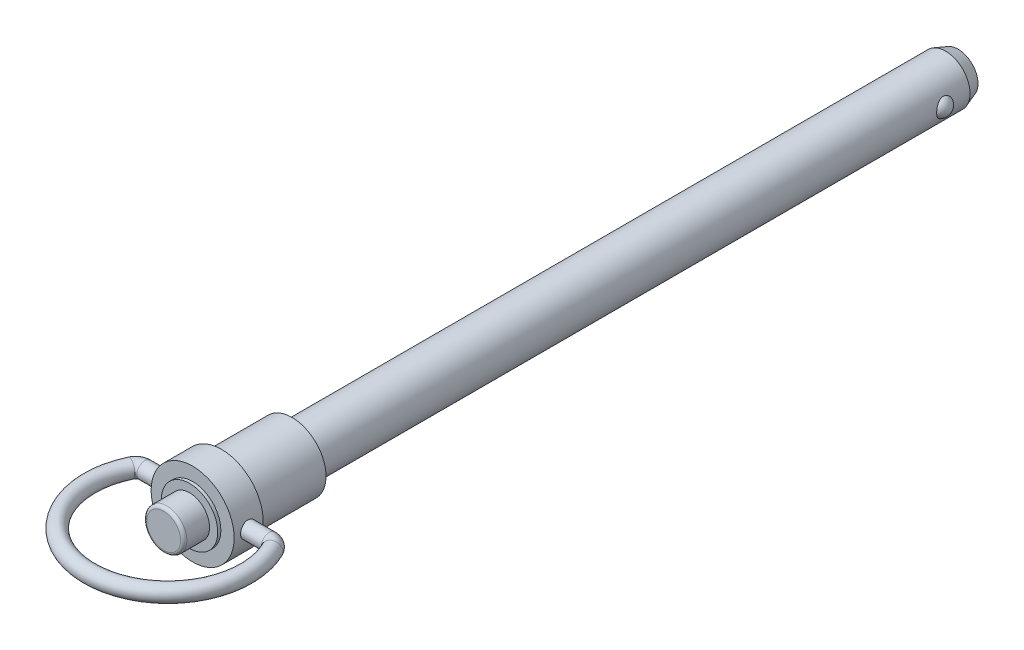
ISO-10303-21;
HEADER;
FILE_DESCRIPTION(('STEP AP214'),'2;1');
FILE_NAME('part.step','',(''),(''),'','','');
FILE_SCHEMA(('AUTOMOTIVE_DESIGN { 1 0 10303 214 1 1 1 1 }'));
ENDSEC;
DATA;
#1=APPLICATION_CONTEXT('core data for automotive mechanical design processes');
#2=APPLICATION_PROTOCOL_DEFINITION('international standard','automotive_design',2000,#1);
#3=PRODUCT_CONTEXT('',#1,'mechanical');
#4=PRODUCT('Part','Part','',(#3));
#5=PRODUCT_RELATED_PRODUCT_CATEGORY('part','',(#4));
#6=PRODUCT_DEFINITION_FORMATION('','',#4);
#7=PRODUCT_DEFINITION_CONTEXT('part definition',#1,'design');
#8=PRODUCT_DEFINITION('design','',#6,#7);
#9=PRODUCT_DEFINITION_SHAPE('','',#8);
#10=(LENGTH_UNIT() NAMED_UNIT(*) SI_UNIT(.MILLI.,.METRE.));
#11=(NAMED_UNIT(*) PLANE_ANGLE_UNIT() SI_UNIT($,.RADIAN.));
#12=(NAMED_UNIT(*) SI_UNIT($,.STERADIAN.) SOLID_ANGLE_UNIT());
#13=UNCERTAINTY_MEASURE_WITH_UNIT(LENGTH_MEASURE(1.E-05),#10,'distance_accuracy_value','');
#14=(GEOMETRIC_REPRESENTATION_CONTEXT(3) GLOBAL_UNCERTAINTY_ASSIGNED_CONTEXT((#13)) GLOBAL_UNIT_ASSIGNED_CONTEXT((#10,
#11,#12)) REPRESENTATION_CONTEXT('',''));
#15=CARTESIAN_POINT('',(0.,0.,0.));
#16=DIRECTION('',(0.,0.,1.));
#17=DIRECTION('',(1.,0.,0.));
#18=AXIS2_PLACEMENT_3D('',#15,#16,#17);
#19=CARTESIAN_POINT('',(0.,0.,20.828));
#20=DIRECTION('',(0.,0.,1.));
#21=DIRECTION('',(0.,-1.,0.));
#22=AXIS2_PLACEMENT_3D('',#19,#20,#21);
#23=PLANE('',#22);
#24=CARTESIAN_POINT('',(0.,0.,20.828));
#25=DIRECTION('',(0.,0.,-1.));
#26=DIRECTION('',(0.,1.,0.));
#27=AXIS2_PLACEMENT_3D('',#24,#25,#26);
#28=CIRCLE('',#27,2.7432);
#29=CARTESIAN_POINT('',(0.,2.7432,20.828));
#30=VERTEX_POINT('',#29);
#31=CARTESIAN_POINT('',(0.,-2.7432,20.828));
#32=VERTEX_POINT('',#31);
#33=EDGE_CURVE('E35',#30,#32,#28,.T.);
#34=ORIENTED_EDGE('',*,*,#33,.F.);
#35=CARTESIAN_POINT('',(0.,0.,20.828));
#36=DIRECTION('',(0.,0.,-1.));
#37=DIRECTION('',(0.,-1.,0.));
#38=AXIS2_PLACEMENT_3D('',#35,#36,#37);
#39=CIRCLE('',#38,2.7432);
#40=EDGE_CURVE('E28',#32,#30,#39,.T.);
#41=ORIENTED_EDGE('',*,*,#40,.F.);
#42=EDGE_LOOP('',(#34,#41));
#43=FACE_BOUND('',#42,.T.);
#44=ADVANCED_FACE('F14',(#43),#23,.T.);
#45=CARTESIAN_POINT('',(0.,0.,20.32));
#46=DIRECTION('',(0.,0.,1.));
#47=DIRECTION('',(0.,-1.,0.));
#48=AXIS2_PLACEMENT_3D('',#45,#46,#47);
#49=TOROIDAL_SURFACE('',#48,2.7432,0.508);
#50=ORIENTED_EDGE('',*,*,#40,.T.);
#51=ORIENTED_EDGE('',*,*,#33,.T.);
#52=EDGE_LOOP('',(#50,#51));
#53=FACE_BOUND('',#52,.T.);
#54=CARTESIAN_POINT('',(0.,0.,20.32));
#55=DIRECTION('',(0.,0.,-1.));
#56=DIRECTION('',(0.,1.,0.));
#57=AXIS2_PLACEMENT_3D('',#54,#55,#56);
#58=CIRCLE('',#57,3.2512);
#59=CARTESIAN_POINT('',(0.,3.2512,20.32));
#60=VERTEX_POINT('',#59);
#61=EDGE_CURVE('E113',#60,#60,#58,.T.);
#62=ORIENTED_EDGE('',*,*,#61,.F.);
#63=EDGE_LOOP('',(#62));
#64=FACE_BOUND('',#63,.T.);
#65=ADVANCED_FACE('F33',(#53,#64),#49,.T.);
#66=CARTESIAN_POINT('',(0.,0.,20.828));
#67=DIRECTION('',(0.,0.,-1.));
#68=DIRECTION('',(0.,1.,0.));
#69=AXIS2_PLACEMENT_3D('',#66,#67,#68);
#70=CYLINDRICAL_SURFACE('',#69,3.2512);
#71=CARTESIAN_POINT('',(0.,0.,16.637));
#72=DIRECTION('',(0.,0.,-1.));
#73=DIRECTION('',(0.,1.,0.));
#74=AXIS2_PLACEMENT_3D('',#71,#72,#73);
#75=CIRCLE('',#74,3.2512);
#76=CARTESIAN_POINT('',(0.,3.2512,16.637));
#77=VERTEX_POINT('',#76);
#78=EDGE_CURVE('E106',#77,#77,#75,.T.);
#79=ORIENTED_EDGE('',*,*,#78,.F.);
#80=EDGE_LOOP('',(#79));
#81=FACE_BOUND('',#80,.T.);
#82=ORIENTED_EDGE('',*,*,#61,.T.);
#83=EDGE_LOOP('',(#82));
#84=FACE_BOUND('',#83,.T.);
#85=ADVANCED_FACE('F89',(#81,#84),#70,.T.);
#86=CARTESIAN_POINT('',(4.572,0.,16.637));
#87=DIRECTION('',(0.,0.,1.));
#88=DIRECTION('',(0.,-1.,0.));
#89=AXIS2_PLACEMENT_3D('',#86,#87,#88);
#90=PLANE('',#89);
#91=ORIENTED_EDGE('',*,*,#78,.T.);
#92=EDGE_LOOP('',(#91));
#93=FACE_BOUND('',#92,.T.);
#94=CARTESIAN_POINT('',(0.,0.,16.637));
#95=DIRECTION('',(0.,0.,-1.));
#96=DIRECTION('',(0.,1.,0.));
#97=AXIS2_PLACEMENT_3D('',#94,#95,#96);
#98=CIRCLE('',#97,4.572);
#99=CARTESIAN_POINT('',(0.,4.572,16.637));
#100=VERTEX_POINT('',#99);
#101=EDGE_CURVE('E105',#100,#100,#98,.T.);
#102=ORIENTED_EDGE('',*,*,#101,.F.);
#103=EDGE_LOOP('',(#102));
#104=FACE_BOUND('',#103,.T.);
#105=ADVANCED_FACE('F92',(#93,#104),#90,.T.);
#106=CARTESIAN_POINT('',(0.,0.,0.));
#107=DIRECTION('',(0.,0.,-1.));
#108=DIRECTION('',(0.,1.,0.));
#109=AXIS2_PLACEMENT_3D('',#106,#107,#108);
#110=CYLINDRICAL_SURFACE('',#109,4.572);
#111=ORIENTED_EDGE('',*,*,#101,.T.);
#112=EDGE_LOOP('',(#111));
#113=FACE_BOUND('',#112,.T.);
#114=CARTESIAN_POINT('',(0.,0.,16.129));
#115=DIRECTION('',(0.,0.,-1.));
#116=DIRECTION('',(0.,1.,0.));
#117=AXIS2_PLACEMENT_3D('',#114,#115,#116);
#118=CIRCLE('',#117,4.572);
#119=CARTESIAN_POINT('',(0.,4.572,16.129));
#120=VERTEX_POINT('',#119);
#121=EDGE_CURVE('E133',#120,#120,#118,.T.);
#122=ORIENTED_EDGE('',*,*,#121,.F.);
#123=EDGE_LOOP('',(#122));
#124=FACE_BOUND('',#123,.T.);
#125=ADVANCED_FACE('F272',(#113,#124),#110,.T.);
#126=CARTESIAN_POINT('',(6.731,0.,16.129));
#127=DIRECTION('',(0.,0.,1.));
#128=DIRECTION('',(0.,-1.,0.));
#129=AXIS2_PLACEMENT_3D('',#126,#127,#128);
#130=PLANE('',#129);
#131=CARTESIAN_POINT('',(0.,0.,16.129));
#132=DIRECTION('',(0.,0.,-1.));
#133=DIRECTION('',(0.,1.,0.));
#134=AXIS2_PLACEMENT_3D('',#131,#132,#133);
#135=CIRCLE('',#134,6.731);
#136=CARTESIAN_POINT('',(0.,6.731,16.129));
#137=VERTEX_POINT('',#136);
#138=EDGE_CURVE('E130',#137,#137,#135,.T.);
#139=ORIENTED_EDGE('',*,*,#138,.F.);
#140=EDGE_LOOP('',(#139));
#141=FACE_BOUND('',#140,.T.);
#142=ORIENTED_EDGE('',*,*,#121,.T.);
#143=EDGE_LOOP('',(#142));
#144=FACE_BOUND('',#143,.T.);
#145=ADVANCED_FACE('F154',(#141,#144),#130,.T.);
#146=CARTESIAN_POINT('',(0.,0.,0.));
#147=DIRECTION('',(0.,0.,-1.));
#148=DIRECTION('',(0.,1.,0.));
#149=AXIS2_PLACEMENT_3D('',#146,#147,#148);
#150=CYLINDRICAL_SURFACE('',#149,6.731);
#151=CARTESIAN_POINT('',(0.,0.,11.43));
#152=DIRECTION('',(0.,0.,-1.));
#153=DIRECTION('',(0.,1.,0.));
#154=AXIS2_PLACEMENT_3D('',#151,#152,#153);
#155=CIRCLE('',#154,6.731);
#156=CARTESIAN_POINT('',(0.,6.731,11.43));
#157=VERTEX_POINT('',#156);
#158=EDGE_CURVE('E121',#157,#157,#155,.T.);
#159=ORIENTED_EDGE('',*,*,#158,.F.);
#160=EDGE_LOOP('',(#159));
#161=FACE_BOUND('',#160,.T.);
#162=ORIENTED_EDGE('',*,*,#138,.T.);
#163=EDGE_LOOP('',(#162));
#164=FACE_BOUND('',#163,.T.);
#165=CARTESIAN_POINT('',(-6.6051722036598,1.2954,13.7922));
#166=CARTESIAN_POINT('',(-6.60517361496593,1.2953972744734,13.864236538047));
#167=CARTESIAN_POINT('',(-6.60636346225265,1.28937073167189,13.9363080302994));
#168=CARTESIAN_POINT('',(-6.61098794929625,1.26544153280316,14.0784162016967));
#169=CARTESIAN_POINT('',(-6.61442445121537,1.24752902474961,14.1484511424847));
#170=CARTESIAN_POINT('',(-6.62313895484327,1.20040052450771,14.2844095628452));
#171=CARTESIAN_POINT('',(-6.62841519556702,1.17119533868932,14.3503369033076));
#172=CARTESIAN_POINT('',(-6.64021258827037,1.10233951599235,14.4763528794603));
#173=CARTESIAN_POINT('',(-6.64673365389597,1.06268960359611,14.5364419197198));
#174=CARTESIAN_POINT('',(-6.66038139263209,0.973516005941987,14.6498669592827));
#175=CARTESIAN_POINT('',(-6.66751428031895,0.9238817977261,14.7031153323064));
#176=CARTESIAN_POINT('',(-6.68152715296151,0.816387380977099,14.8005834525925));
#177=CARTESIAN_POINT('',(-6.6884071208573,0.758526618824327,14.8448025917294));
#178=CARTESIAN_POINT('',(-6.7012057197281,0.635644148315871,14.9232944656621));
#179=CARTESIAN_POINT('',(-6.70711617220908,0.570568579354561,14.9574843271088));
#180=CARTESIAN_POINT('',(-6.71724013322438,0.435464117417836,15.014412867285));
#181=CARTESIAN_POINT('',(-6.72145378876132,0.365435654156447,15.0371525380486));
#182=CARTESIAN_POINT('',(-6.72766549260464,0.223321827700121,15.0702635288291));
#183=CARTESIAN_POINT('',(-6.72968999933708,0.151272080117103,15.0807826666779));
#184=CARTESIAN_POINT('',(-6.73138656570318,0.00640388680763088,15.089614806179));
#185=CARTESIAN_POINT('',(-6.73105883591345,-0.0664144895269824,15.0879289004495));
#186=CARTESIAN_POINT('',(-6.72810846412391,-0.209738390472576,15.072511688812));
#187=CARTESIAN_POINT('',(-6.72551615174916,-0.280261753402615,15.0589395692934));
#188=CARTESIAN_POINT('',(-6.71836197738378,-0.418011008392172,15.0203872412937));
#189=CARTESIAN_POINT('',(-6.71380004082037,-0.485236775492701,14.9954066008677));
#190=CARTESIAN_POINT('',(-6.70316878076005,-0.614941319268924,14.9345963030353));
#191=CARTESIAN_POINT('',(-6.69709072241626,-0.67738974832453,14.8987035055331));
#192=CARTESIAN_POINT('',(-6.68409856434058,-0.795436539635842,14.8171343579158));
#193=CARTESIAN_POINT('',(-6.677184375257,-0.851034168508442,14.7714569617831));
#194=CARTESIAN_POINT('',(-6.66315320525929,-0.954744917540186,14.6707395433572));
#195=CARTESIAN_POINT('',(-6.65603475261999,-1.00272266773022,14.6155602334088));
#196=CARTESIAN_POINT('',(-6.64250376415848,-1.08876420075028,14.4978679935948));
#197=CARTESIAN_POINT('',(-6.63609123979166,-1.12682782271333,14.4353549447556));
#198=CARTESIAN_POINT('',(-6.62469571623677,-1.19200234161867,14.3045844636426));
#199=CARTESIAN_POINT('',(-6.61971540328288,-1.21909269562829,14.2363165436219));
#200=CARTESIAN_POINT('',(-6.61178862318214,-1.26138008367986,14.0960804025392));
#201=CARTESIAN_POINT('',(-6.60884191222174,-1.27657854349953,14.0241126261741));
#202=CARTESIAN_POINT('',(-6.60536444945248,-1.29445125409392,13.8797427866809));
#203=CARTESIAN_POINT('',(-6.60479610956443,-1.29732037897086,13.8073657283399));
#204=CARTESIAN_POINT('',(-6.60603903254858,-1.29097613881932,13.6631669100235));
#205=CARTESIAN_POINT('',(-6.60785017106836,-1.28176340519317,13.5913451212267));
#206=CARTESIAN_POINT('',(-6.6136128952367,-1.25168453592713,13.4509418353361));
#207=CARTESIAN_POINT('',(-6.61754556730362,-1.23092132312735,13.3823374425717));
#208=CARTESIAN_POINT('',(-6.62709183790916,-1.17844042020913,13.249581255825));
#209=CARTESIAN_POINT('',(-6.63270556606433,-1.14672188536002,13.1854298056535));
#210=CARTESIAN_POINT('',(-6.6450665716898,-1.07278507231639,13.0625442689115));
#211=CARTESIAN_POINT('',(-6.65182676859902,-1.03044414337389,13.0038853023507));
#212=CARTESIAN_POINT('',(-6.66568301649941,-0.936629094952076,12.8944341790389));
#213=CARTESIAN_POINT('',(-6.67277909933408,-0.885154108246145,12.8436427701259));
#214=CARTESIAN_POINT('',(-6.68662882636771,-0.773660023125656,12.7506362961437));
#215=CARTESIAN_POINT('',(-6.69337621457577,-0.713530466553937,12.7085525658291));
#216=CARTESIAN_POINT('',(-6.70566168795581,-0.586941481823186,12.6350847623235));
#217=CARTESIAN_POINT('',(-6.71119982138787,-0.520482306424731,12.6037002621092));
#218=CARTESIAN_POINT('',(-6.72041595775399,-0.383476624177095,12.5527164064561));
#219=CARTESIAN_POINT('',(-6.72410395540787,-0.312954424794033,12.5330536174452));
#220=CARTESIAN_POINT('',(-6.72924701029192,-0.169530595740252,12.5058694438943));
#221=CARTESIAN_POINT('',(-6.7307023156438,-0.0966292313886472,12.4983467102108));
#222=CARTESIAN_POINT('',(-6.73121071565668,0.0482259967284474,12.4957052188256));
#223=CARTESIAN_POINT('',(-6.73030215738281,0.120176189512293,12.5003884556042));
#224=CARTESIAN_POINT('',(-6.72626496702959,0.26224403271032,12.5215909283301));
#225=CARTESIAN_POINT('',(-6.72313635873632,0.332361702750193,12.5381100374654));
#226=CARTESIAN_POINT('',(-6.71501101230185,0.468662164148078,12.5824301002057));
#227=CARTESIAN_POINT('',(-6.710017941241,0.534852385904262,12.6102089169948));
#228=CARTESIAN_POINT('',(-6.69870305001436,0.661661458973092,12.6762356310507));
#229=CARTESIAN_POINT('',(-6.69238113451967,0.722279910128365,12.7144842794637));
#230=CARTESIAN_POINT('',(-6.6789853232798,0.837208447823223,12.8010411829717));
#231=CARTESIAN_POINT('',(-6.67190155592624,0.891410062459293,12.8494919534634));
#232=CARTESIAN_POINT('',(-6.65784127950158,0.990982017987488,12.95478313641));
#233=CARTESIAN_POINT('',(-6.65086479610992,1.03635027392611,13.0116255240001));
#234=CARTESIAN_POINT('',(-6.63773378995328,1.11738877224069,13.1327559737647));
#235=CARTESIAN_POINT('',(-6.63158802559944,1.15295925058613,13.1971117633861));
#236=CARTESIAN_POINT('',(-6.62092027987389,1.21272619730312,13.3309847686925));
#237=CARTESIAN_POINT('',(-6.61639678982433,1.23693323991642,13.4004971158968));
#238=CARTESIAN_POINT('',(-6.61041337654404,1.26845390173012,13.5238636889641));
#239=CARTESIAN_POINT('',(-6.60845980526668,1.27854107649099,13.57700269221));
#240=CARTESIAN_POINT('',(-6.60583870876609,1.29201504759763,13.6841545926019));
#241=CARTESIAN_POINT('',(-6.60517114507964,1.29540204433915,13.7381674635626));
#242=CARTESIAN_POINT('',(-6.6051722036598,1.2954,13.7922));
#243=B_SPLINE_CURVE_WITH_KNOTS('',3,(#165,#166,#167,#168,#169,#170,#171,#172,#173,#174,#175,
#176,#177,#178,#179,#180,#181,#182,#183,#184,#185,#186,#187,#188,#189,#190,#191,#192,#193,#194,
#195,#196,#197,#198,#199,#200,#201,#202,#203,#204,#205,#206,#207,#208,#209,#210,#211,#212,#213,
#214,#215,#216,#217,#218,#219,#220,#221,#222,#223,#224,#225,#226,#227,#228,#229,#230,#231,#232,
#233,#234,#235,#236,#237,#238,#239,#240,#241,#242),.UNSPECIFIED.,.T.,.F.,(4,2,2,2,2,2,2,2,2,2,2,
2,2,2,2,2,2,2,2,2,2,2,2,2,2,2,2,2,2,2,2,2,2,2,2,2,2,2,4),(0.,0.215911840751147,
0.432002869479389,0.64788762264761,0.86375740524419,1.08216318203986,1.30058366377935,
1.52076118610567,1.74091962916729,1.95838638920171,2.1758336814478,2.39041258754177,
2.60499961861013,2.82085272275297,3.0367289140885,3.25609136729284,3.47545737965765,
3.69523218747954,3.91498064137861,4.13124273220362,4.34749352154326,4.56184753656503,
4.7762180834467,4.99318797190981,5.21017847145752,5.430235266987,5.65028327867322,
5.86912939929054,6.08795119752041,6.30324544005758,6.51853737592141,6.73340808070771,
6.94829420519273,7.16640910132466,7.38457541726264,7.60488731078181,7.82499378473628,
7.9869478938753,8.14889715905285),.UNSPECIFIED.);
#244=CARTESIAN_POINT('',(-6.6051722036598,1.2954,13.7922));
#245=VERTEX_POINT('',#244);
#246=EDGE_CURVE('E365',#245,#245,#243,.T.);
#247=ORIENTED_EDGE('',*,*,#246,.T.);
#248=EDGE_LOOP('',(#247));
#249=FACE_BOUND('',#248,.T.);
#250=CARTESIAN_POINT('',(6.6051722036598,1.2954,13.7922));
#251=CARTESIAN_POINT('',(6.60517361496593,1.2953972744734,13.720163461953));
#252=CARTESIAN_POINT('',(6.60636346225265,1.2893707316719,13.6480919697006));
#253=CARTESIAN_POINT('',(6.61098794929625,1.26544153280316,13.5059837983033));
#254=CARTESIAN_POINT('',(6.61442445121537,1.24752902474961,13.4359488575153));
#255=CARTESIAN_POINT('',(6.62313895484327,1.20040052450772,13.2999904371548));
#256=CARTESIAN_POINT('',(6.62841519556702,1.17119533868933,13.2340630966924));
#257=CARTESIAN_POINT('',(6.64021258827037,1.10233951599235,13.1080471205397));
#258=CARTESIAN_POINT('',(6.64673365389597,1.06268960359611,13.0479580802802));
#259=CARTESIAN_POINT('',(6.66038139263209,0.973516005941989,12.9345330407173));
#260=CARTESIAN_POINT('',(6.66751428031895,0.923881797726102,12.8812846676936));
#261=CARTESIAN_POINT('',(6.68152715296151,0.816387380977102,12.7838165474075));
#262=CARTESIAN_POINT('',(6.6884071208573,0.758526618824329,12.7395974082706));
#263=CARTESIAN_POINT('',(6.7012057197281,0.635644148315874,12.6611055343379));
#264=CARTESIAN_POINT('',(6.70711617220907,0.570568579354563,12.6269156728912));
#265=CARTESIAN_POINT('',(6.71724013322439,0.435464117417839,12.569987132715));
#266=CARTESIAN_POINT('',(6.72145378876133,0.36543565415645,12.5472474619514));
#267=CARTESIAN_POINT('',(6.72766549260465,0.223321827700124,12.5141364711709));
#268=CARTESIAN_POINT('',(6.72968999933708,0.151272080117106,12.5036173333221));
#269=CARTESIAN_POINT('',(6.73138656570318,0.00640388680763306,12.494785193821));
#270=CARTESIAN_POINT('',(6.73105883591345,-0.0664144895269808,12.4964710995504));
#271=CARTESIAN_POINT('',(6.72810846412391,-0.209738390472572,12.511888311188));
#272=CARTESIAN_POINT('',(6.72551615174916,-0.280261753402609,12.5254604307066));
#273=CARTESIAN_POINT('',(6.71836197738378,-0.418011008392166,12.5640127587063));
#274=CARTESIAN_POINT('',(6.71380004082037,-0.4852367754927,12.5889933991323));
#275=CARTESIAN_POINT('',(6.70316878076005,-0.614941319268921,12.6498036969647));
#276=CARTESIAN_POINT('',(6.69709072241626,-0.67738974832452,12.6856964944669));
#277=CARTESIAN_POINT('',(6.68409856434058,-0.795436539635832,12.7672656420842));
#278=CARTESIAN_POINT('',(6.677184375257,-0.851034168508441,12.8129430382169));
#279=CARTESIAN_POINT('',(6.66315320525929,-0.954744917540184,12.9136604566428));
#280=CARTESIAN_POINT('',(6.65603475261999,-1.00272266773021,12.9688397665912));
#281=CARTESIAN_POINT('',(6.64250376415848,-1.08876420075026,13.0865320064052));
#282=CARTESIAN_POINT('',(6.63609123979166,-1.12682782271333,13.1490450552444));
#283=CARTESIAN_POINT('',(6.62469571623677,-1.19200234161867,13.2798155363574));
#284=CARTESIAN_POINT('',(6.61971540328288,-1.21909269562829,13.3480834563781));
#285=CARTESIAN_POINT('',(6.61178862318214,-1.26138008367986,13.4883195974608));
#286=CARTESIAN_POINT('',(6.60884191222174,-1.27657854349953,13.5602873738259));
#287=CARTESIAN_POINT('',(6.60536444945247,-1.29445125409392,13.7046572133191));
#288=CARTESIAN_POINT('',(6.60479610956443,-1.29732037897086,13.7770342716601));
#289=CARTESIAN_POINT('',(6.60603903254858,-1.29097613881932,13.9212330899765));
#290=CARTESIAN_POINT('',(6.60785017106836,-1.28176340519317,13.9930548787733));
#291=CARTESIAN_POINT('',(6.6136128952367,-1.25168453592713,14.1334581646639));
#292=CARTESIAN_POINT('',(6.61754556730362,-1.23092132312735,14.2020625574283));
#293=CARTESIAN_POINT('',(6.62709183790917,-1.17844042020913,14.334818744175));
#294=CARTESIAN_POINT('',(6.63270556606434,-1.14672188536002,14.3989701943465));
#295=CARTESIAN_POINT('',(6.64506657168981,-1.07278507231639,14.5218557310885));
#296=CARTESIAN_POINT('',(6.65182676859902,-1.03044414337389,14.5805146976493));
#297=CARTESIAN_POINT('',(6.66568301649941,-0.936629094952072,14.6899658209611));
#298=CARTESIAN_POINT('',(6.67277909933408,-0.885154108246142,14.7407572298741));
#299=CARTESIAN_POINT('',(6.68662882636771,-0.773660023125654,14.8337637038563));
#300=CARTESIAN_POINT('',(6.69337621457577,-0.713530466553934,14.8758474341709));
#301=CARTESIAN_POINT('',(6.70566168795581,-0.586941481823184,14.9493152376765));
#302=CARTESIAN_POINT('',(6.71119982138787,-0.520482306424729,14.9806997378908));
#303=CARTESIAN_POINT('',(6.72041595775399,-0.383476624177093,15.0316835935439));
#304=CARTESIAN_POINT('',(6.72410395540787,-0.31295442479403,15.0513463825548));
#305=CARTESIAN_POINT('',(6.72924701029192,-0.169530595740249,15.0785305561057));
#306=CARTESIAN_POINT('',(6.7307023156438,-0.0966292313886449,15.0860532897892));
#307=CARTESIAN_POINT('',(6.73121071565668,0.0482259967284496,15.0886947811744));
#308=CARTESIAN_POINT('',(6.73030215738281,0.120176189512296,15.0840115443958));
#309=CARTESIAN_POINT('',(6.72626496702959,0.262244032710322,15.0628090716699));
#310=CARTESIAN_POINT('',(6.72313635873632,0.332361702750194,15.0462899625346));
#311=CARTESIAN_POINT('',(6.71501101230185,0.46866216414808,15.0019698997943));
#312=CARTESIAN_POINT('',(6.710017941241,0.534852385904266,14.9741910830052));
#313=CARTESIAN_POINT('',(6.69870305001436,0.661661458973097,14.9081643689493));
#314=CARTESIAN_POINT('',(6.69238113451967,0.722279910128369,14.8699157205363));
#315=CARTESIAN_POINT('',(6.6789853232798,0.837208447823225,14.7833588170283));
#316=CARTESIAN_POINT('',(6.67190155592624,0.891410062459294,14.7349080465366));
#317=CARTESIAN_POINT('',(6.65784127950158,0.990982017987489,14.62961686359));
#318=CARTESIAN_POINT('',(6.65086479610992,1.03635027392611,14.5727744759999));
#319=CARTESIAN_POINT('',(6.63773378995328,1.1173887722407,14.4516440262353));
#320=CARTESIAN_POINT('',(6.63158802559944,1.15295925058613,14.3872882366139));
#321=CARTESIAN_POINT('',(6.62092027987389,1.21272619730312,14.2534152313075));
#322=CARTESIAN_POINT('',(6.61639678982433,1.23693323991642,14.1839028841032));
#323=CARTESIAN_POINT('',(6.61041337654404,1.26845390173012,14.0605363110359));
#324=CARTESIAN_POINT('',(6.60845980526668,1.27854107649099,14.00739730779));
#325=CARTESIAN_POINT('',(6.60583870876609,1.29201504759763,13.9002454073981));
#326=CARTESIAN_POINT('',(6.60517114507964,1.29540204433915,13.8462325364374));
#327=CARTESIAN_POINT('',(6.6051722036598,1.2954,13.7922));
#328=B_SPLINE_CURVE_WITH_KNOTS('',3,(#250,#251,#252,#253,#254,#255,#256,#257,#258,#259,#260,
#261,#262,#263,#264,#265,#266,#267,#268,#269,#270,#271,#272,#273,#274,#275,#276,#277,#278,#279,
#280,#281,#282,#283,#284,#285,#286,#287,#288,#289,#290,#291,#292,#293,#294,#295,#296,#297,#298,
#299,#300,#301,#302,#303,#304,#305,#306,#307,#308,#309,#310,#311,#312,#313,#314,#315,#316,#317,
#318,#319,#320,#321,#322,#323,#324,#325,#326,#327),.UNSPECIFIED.,.T.,.F.,(4,2,2,2,2,2,2,2,2,2,2,
2,2,2,2,2,2,2,2,2,2,2,2,2,2,2,2,2,2,2,2,2,2,2,2,2,2,2,4),(0.,0.215911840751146,
0.432002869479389,0.64788762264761,0.86375740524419,1.08216318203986,1.30058366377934,
1.52076118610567,1.74091962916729,1.95838638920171,2.1758336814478,2.39041258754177,
2.60499961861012,2.82085272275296,3.0367289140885,3.25609136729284,3.47545737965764,
3.69523218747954,3.91498064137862,4.13124273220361,4.34749352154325,4.56184753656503,
4.77621808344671,4.99318797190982,5.21017847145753,5.43023526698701,5.65028327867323,
5.86912939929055,6.08795119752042,6.30324544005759,6.51853737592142,6.73340808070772,
6.94829420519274,7.16640910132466,7.38457541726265,7.60488731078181,7.82499378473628,
7.98694789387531,8.14889715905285),.UNSPECIFIED.);
#329=CARTESIAN_POINT('',(6.6051722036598,1.2954,13.7922));
#330=VERTEX_POINT('',#329);
#331=EDGE_CURVE('E209',#330,#330,#328,.T.);
#332=ORIENTED_EDGE('',*,*,#331,.T.);
#333=EDGE_LOOP('',(#332));
#334=FACE_BOUND('',#333,.T.);
#335=ADVANCED_FACE('F148',(#161,#164,#249,#334),#150,.T.);
#336=CARTESIAN_POINT('',(5.7785,0.,11.43));
#337=DIRECTION('',(0.,0.,-1.));
#338=DIRECTION('',(0.,1.,0.));
#339=AXIS2_PLACEMENT_3D('',#336,#337,#338);
#340=PLANE('',#339);
#341=CARTESIAN_POINT('',(0.,0.,11.43));
#342=DIRECTION('',(0.,0.,-1.));
#343=DIRECTION('',(0.,1.,0.));
#344=AXIS2_PLACEMENT_3D('',#341,#342,#343);
#345=CIRCLE('',#344,5.9);
#346=CARTESIAN_POINT('',(0.,5.9,11.43));
#347=VERTEX_POINT('',#346);
#348=EDGE_CURVE('E22',#347,#347,#345,.F.);
#349=ORIENTED_EDGE('',*,*,#348,.T.);
#350=EDGE_LOOP('',(#349));
#351=FACE_BOUND('',#350,.T.);
#352=ORIENTED_EDGE('',*,*,#158,.T.);
#353=EDGE_LOOP('',(#352));
#354=FACE_BOUND('',#353,.T.);
#355=ADVANCED_FACE('F87',(#351,#354),#340,.T.);
#356=CARTESIAN_POINT('',(10.0803124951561,0.,15.3162));
#357=DIRECTION('',(0.,1.,0.));
#358=DIRECTION('',(-1.,0.,0.));
#359=AXIS2_PLACEMENT_3D('',#356,#357,#358);
#360=TOROIDAL_SURFACE('',#359,1.524,1.2954);
#361=CARTESIAN_POINT('',(11.4549005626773,0.,14.658109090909));
#362=DIRECTION('',(-0.431818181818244,0.,-0.901960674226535));
#363=DIRECTION('',(0.901960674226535,0.,-0.431818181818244));
#364=AXIS2_PLACEMENT_3D('',#361,#362,#363);
#365=CIRCLE('',#364,1.2954);
#366=CARTESIAN_POINT('',(12.6233004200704,0.,14.0987318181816));
#367=VERTEX_POINT('',#366);
#368=EDGE_CURVE('E41',#367,#367,#365,.T.);
#369=ORIENTED_EDGE('',*,*,#368,.T.);
#370=EDGE_LOOP('',(#369));
#371=FACE_BOUND('',#370,.T.);
#372=CARTESIAN_POINT('',(10.0803124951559,0.,13.7922));
#373=DIRECTION('',(1.,0.,0.));
#374=DIRECTION('',(0.,1.,0.));
#375=AXIS2_PLACEMENT_3D('',#372,#373,#374);
#376=CIRCLE('',#375,1.2954);
#377=CARTESIAN_POINT('',(10.0803124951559,1.2954,13.7922));
#378=VERTEX_POINT('',#377);
#379=EDGE_CURVE('E107',#378,#378,#376,.F.);
#380=ORIENTED_EDGE('',*,*,#379,.F.);
#381=EDGE_LOOP('',(#380));
#382=FACE_BOUND('',#381,.T.);
#383=ADVANCED_FACE('F59',(#371,#382),#360,.T.);
#384=CARTESIAN_POINT('',(-10.0803124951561,0.,13.7922));
#385=DIRECTION('',(1.,0.,0.));
#386=DIRECTION('',(0.,1.,0.));
#387=AXIS2_PLACEMENT_3D('',#384,#385,#386);
#388=CYLINDRICAL_SURFACE('',#387,1.2954);
#389=ORIENTED_EDGE('',*,*,#331,.F.);
#390=EDGE_LOOP('',(#389));
#391=FACE_BOUND('',#390,.T.);
#392=ORIENTED_EDGE('',*,*,#379,.T.);
#393=EDGE_LOOP('',(#392));
#394=FACE_BOUND('',#393,.T.);
#395=ADVANCED_FACE('F83',(#391,#394),#388,.T.);
#396=CARTESIAN_POINT('',(0.,0.,20.1422));
#397=DIRECTION('',(0.,1.,0.));
#398=DIRECTION('',(-1.,0.,0.));
#399=AXIS2_PLACEMENT_3D('',#396,#397,#398);
#400=TOROIDAL_SURFACE('',#399,12.7,1.2954);
#401=CARTESIAN_POINT('',(-11.4549005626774,0.,14.658109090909));
#402=DIRECTION('',(-0.43181818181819,0.,0.901960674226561));
#403=DIRECTION('',(-0.901960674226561,0.,-0.43181818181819));
#404=AXIS2_PLACEMENT_3D('',#401,#402,#403);
#405=CIRCLE('',#404,1.2954);
#406=CARTESIAN_POINT('',(-12.6233004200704,0.,14.0987318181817));
#407=VERTEX_POINT('',#406);
#408=EDGE_CURVE('E110',#407,#407,#405,.F.);
#409=ORIENTED_EDGE('',*,*,#408,.F.);
#410=EDGE_LOOP('',(#409));
#411=FACE_BOUND('',#410,.T.);
#412=ORIENTED_EDGE('',*,*,#368,.F.);
#413=EDGE_LOOP('',(#412));
#414=FACE_BOUND('',#413,.T.);
#415=ADVANCED_FACE('F79',(#411,#414),#400,.T.);
#416=CARTESIAN_POINT('',(-10.0803124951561,0.,15.3162));
#417=DIRECTION('',(0.,1.,0.));
#418=DIRECTION('',(-1.,0.,0.));
#419=AXIS2_PLACEMENT_3D('',#416,#417,#418);
#420=TOROIDAL_SURFACE('',#419,1.524,1.2954);
#421=CARTESIAN_POINT('',(-10.0803124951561,0.,13.7922));
#422=DIRECTION('',(1.,0.,0.));
#423=DIRECTION('',(0.,1.,0.));
#424=AXIS2_PLACEMENT_3D('',#421,#422,#423);
#425=CIRCLE('',#424,1.2954);
#426=CARTESIAN_POINT('',(-10.0803124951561,1.2954,13.7922));
#427=VERTEX_POINT('',#426);
#428=EDGE_CURVE('E102',#427,#427,#425,.T.);
#429=ORIENTED_EDGE('',*,*,#428,.F.);
#430=EDGE_LOOP('',(#429));
#431=FACE_BOUND('',#430,.T.);
#432=ORIENTED_EDGE('',*,*,#408,.T.);
#433=EDGE_LOOP('',(#432));
#434=FACE_BOUND('',#433,.T.);
#435=ADVANCED_FACE('F82',(#431,#434),#420,.T.);
#436=CARTESIAN_POINT('',(-10.0803124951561,0.,13.7922));
#437=DIRECTION('',(1.,0.,0.));
#438=DIRECTION('',(0.,1.,0.));
#439=AXIS2_PLACEMENT_3D('',#436,#437,#438);
#440=CYLINDRICAL_SURFACE('',#439,1.2954);
#441=ORIENTED_EDGE('',*,*,#246,.F.);
#442=EDGE_LOOP('',(#441));
#443=FACE_BOUND('',#442,.T.);
#444=ORIENTED_EDGE('',*,*,#428,.T.);
#445=EDGE_LOOP('',(#444));
#446=FACE_BOUND('',#445,.T.);
#447=ADVANCED_FACE('F96',(#443,#446),#440,.T.);
#448=CARTESIAN_POINT('',(0.,0.,39.7354565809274));
#449=DIRECTION('',(0.,0.,-1.));
#450=DIRECTION('',(0.,1.,0.));
#451=AXIS2_PLACEMENT_3D('',#448,#449,#450);
#452=CYLINDRICAL_SURFACE('',#451,5.5);
#453=CARTESIAN_POINT('',(0.,0.,11.03));
#454=DIRECTION('',(0.,0.,-1.));
#455=DIRECTION('',(0.,1.,0.));
#456=AXIS2_PLACEMENT_3D('',#453,#454,#455);
#457=CIRCLE('',#456,5.5);
#458=CARTESIAN_POINT('',(0.,5.5,11.03));
#459=VERTEX_POINT('',#458);
#460=EDGE_CURVE('E9',#459,#459,#457,.T.);
#461=ORIENTED_EDGE('',*,*,#460,.T.);
#462=EDGE_LOOP('',(#461));
#463=FACE_BOUND('',#462,.T.);
#464=CARTESIAN_POINT('',(0.,0.,0.));
#465=DIRECTION('',(0.,0.,-1.));
#466=DIRECTION('',(0.,1.,0.));
#467=AXIS2_PLACEMENT_3D('',#464,#465,#466);
#468=CIRCLE('',#467,5.5);
#469=CARTESIAN_POINT('',(0.,5.5,0.));
#470=VERTEX_POINT('',#469);
#471=EDGE_CURVE('E190',#470,#470,#468,.T.);
#472=ORIENTED_EDGE('',*,*,#471,.F.);
#473=EDGE_LOOP('',(#472));
#474=FACE_BOUND('',#473,.T.);
#475=ADVANCED_FACE('F265',(#463,#474),#452,.T.);
#476=CARTESIAN_POINT('',(3.22979748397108,0.,-107.9908));
#477=DIRECTION('',(0.,0.,1.));
#478=DIRECTION('',(0.,-1.,0.));
#479=AXIS2_PLACEMENT_3D('',#476,#477,#478);
#480=PLANE('',#479);
#481=CARTESIAN_POINT('',(0.,0.,-107.990799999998));
#482=DIRECTION('',(0.,0.,1.));
#483=DIRECTION('',(0.,-1.,0.));
#484=AXIS2_PLACEMENT_3D('',#481,#482,#483);
#485=CIRCLE('',#484,3.22979748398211);
#486=CARTESIAN_POINT('',(0.,-3.22979748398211,-107.990799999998));
#487=VERTEX_POINT('',#486);
#488=EDGE_CURVE('E44',#487,#487,#485,.T.);
#489=ORIENTED_EDGE('',*,*,#488,.F.);
#490=EDGE_LOOP('',(#489));
#491=FACE_BOUND('',#490,.T.);
#492=ADVANCED_FACE('F204',(#491),#480,.F.);
#493=CARTESIAN_POINT('',(3.12293,0.,-101.8948));
#494=DIRECTION('',(0.,0.,1.));
#495=DIRECTION('',(1.,0.,0.));
#496=AXIS2_PLACEMENT_3D('',#493,#494,#495);
#497=SPHERICAL_SURFACE('',#496,1.5875);
#498=CARTESIAN_POINT('',(3.969385,0.,-100.551792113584));
#499=CARTESIAN_POINT('',(3.96938133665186,0.0871787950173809,-100.551794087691));
#500=CARTESIAN_POINT('',(3.96648576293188,0.174428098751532,-100.558482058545));
#501=CARTESIAN_POINT('',(3.95516905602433,0.346584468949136,-100.585199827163));
#502=CARTESIAN_POINT('',(3.94674017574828,0.431488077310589,-100.60524833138));
#503=CARTESIAN_POINT('',(3.92519423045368,0.596479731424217,-100.658527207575));
#504=CARTESIAN_POINT('',(3.91207555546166,0.676566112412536,-100.691762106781));
#505=CARTESIAN_POINT('',(3.88253654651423,0.82945224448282,-100.771058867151));
#506=CARTESIAN_POINT('',(3.86611699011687,0.90225370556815,-100.817117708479));
#507=CARTESIAN_POINT('',(3.83222363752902,1.03672093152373,-100.920335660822));
#508=CARTESIAN_POINT('',(3.81477966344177,1.0985904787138,-100.977238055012));
#509=CARTESIAN_POINT('',(3.78068495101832,1.21073548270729,-101.10174626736));
#510=CARTESIAN_POINT('',(3.76403384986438,1.26101628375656,-101.169347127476));
#511=CARTESIAN_POINT('',(3.73507217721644,1.3442647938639,-101.307791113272));
#512=CARTESIAN_POINT('',(3.72252093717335,1.37829571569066,-101.377942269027));
#513=CARTESIAN_POINT('',(3.70178973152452,1.43305274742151,-101.5238520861));
#514=CARTESIAN_POINT('',(3.69360549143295,1.45379187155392,-101.599605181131));
#515=CARTESIAN_POINT('',(3.68341966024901,1.47939277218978,-101.745481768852));
#516=CARTESIAN_POINT('',(3.680835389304,1.4857542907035,-101.815303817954));
#517=CARTESIAN_POINT('',(3.68040725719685,1.48681628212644,-101.955041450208));
#518=CARTESIAN_POINT('',(3.68256179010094,1.48152070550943,-102.024956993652));
#519=CARTESIAN_POINT('',(3.69108766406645,1.46013938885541,-102.158808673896));
#520=CARTESIAN_POINT('',(3.69721728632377,1.44467149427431,-102.222860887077));
#521=CARTESIAN_POINT('',(3.71278611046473,1.40417367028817,-102.347428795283));
#522=CARTESIAN_POINT('',(3.72222570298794,1.37914261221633,-102.407944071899));
#523=CARTESIAN_POINT('',(3.74389633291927,1.3192072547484,-102.526426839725));
#524=CARTESIAN_POINT('',(3.75622345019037,1.28394990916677,-102.584197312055));
#525=CARTESIAN_POINT('',(3.78224213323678,1.20514746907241,-102.693418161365));
#526=CARTESIAN_POINT('',(3.79593412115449,1.16159980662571,-102.744866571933));
#527=CARTESIAN_POINT('',(3.82484228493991,1.06277839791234,-102.845404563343));
#528=CARTESIAN_POINT('',(3.84007638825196,1.00677387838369,-102.893769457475));
#529=CARTESIAN_POINT('',(3.86933265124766,0.887713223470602,-102.981392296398));
#530=CARTESIAN_POINT('',(3.88335410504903,0.824653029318,-103.020644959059));
#531=CARTESIAN_POINT('',(3.90318345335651,0.722863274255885,-103.074011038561));
#532=CARTESIAN_POINT('',(3.90984058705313,0.686009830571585,-103.091471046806));
#533=CARTESIAN_POINT('',(3.92226926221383,0.610957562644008,-103.123476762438));
#534=CARTESIAN_POINT('',(3.92804156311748,0.572759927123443,-103.138024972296));
#535=CARTESIAN_POINT('',(3.94381689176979,0.456514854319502,-103.177248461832));
#536=CARTESIAN_POINT('',(3.95229851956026,0.376714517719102,-103.197554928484));
#537=CARTESIAN_POINT('',(3.96199329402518,0.247044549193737,-103.220533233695));
#538=CARTESIAN_POINT('',(3.96475587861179,0.197910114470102,-103.227007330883));
#539=CARTESIAN_POINT('',(3.96845279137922,0.0991914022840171,-103.235645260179));
#540=CARTESIAN_POINT('',(3.96938708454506,0.0496071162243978,-103.237809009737));
#541=CARTESIAN_POINT('',(3.96938133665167,-0.0871787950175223,-103.237805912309));
#542=CARTESIAN_POINT('',(3.96648576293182,-0.174428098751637,-103.231117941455));
#543=CARTESIAN_POINT('',(3.95516905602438,-0.346584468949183,-103.204400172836));
#544=CARTESIAN_POINT('',(3.94674017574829,-0.431488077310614,-103.18435166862));
#545=CARTESIAN_POINT('',(3.92519423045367,-0.596479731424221,-103.131072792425));
#546=CARTESIAN_POINT('',(3.91207555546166,-0.676566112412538,-103.097837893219));
#547=CARTESIAN_POINT('',(3.88253654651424,-0.829452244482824,-103.018541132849));
#548=CARTESIAN_POINT('',(3.86611699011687,-0.902253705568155,-102.972482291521));
#549=CARTESIAN_POINT('',(3.83222363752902,-1.03672093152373,-102.869264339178));
#550=CARTESIAN_POINT('',(3.81477966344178,-1.09859047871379,-102.812361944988));
#551=CARTESIAN_POINT('',(3.78068495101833,-1.21073548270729,-102.68785373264));
#552=CARTESIAN_POINT('',(3.76403384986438,-1.26101628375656,-102.620252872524));
#553=CARTESIAN_POINT('',(3.73507217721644,-1.34426479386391,-102.481808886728));
#554=CARTESIAN_POINT('',(3.72252093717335,-1.37829571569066,-102.411657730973));
#555=CARTESIAN_POINT('',(3.70178973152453,-1.43305274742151,-102.2657479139));
#556=CARTESIAN_POINT('',(3.69360549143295,-1.45379187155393,-102.189994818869));
#557=CARTESIAN_POINT('',(3.683419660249,-1.47939277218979,-102.044118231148));
#558=CARTESIAN_POINT('',(3.680835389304,-1.4857542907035,-101.974296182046));
#559=CARTESIAN_POINT('',(3.68040725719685,-1.48681628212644,-101.834558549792));
#560=CARTESIAN_POINT('',(3.68256179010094,-1.48152070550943,-101.764643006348));
#561=CARTESIAN_POINT('',(3.69108766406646,-1.4601393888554,-101.630791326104));
#562=CARTESIAN_POINT('',(3.69721728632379,-1.44467149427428,-101.566739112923));
#563=CARTESIAN_POINT('',(3.71278611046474,-1.40417367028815,-101.442171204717));
#564=CARTESIAN_POINT('',(3.72222570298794,-1.37914261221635,-101.3816559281));
#565=CARTESIAN_POINT('',(3.74389633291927,-1.31920725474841,-101.263173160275));
#566=CARTESIAN_POINT('',(3.75622345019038,-1.28394990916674,-101.205402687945));
#567=CARTESIAN_POINT('',(3.7822421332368,-1.20514746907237,-101.096181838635));
#568=CARTESIAN_POINT('',(3.7959341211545,-1.16159980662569,-101.044733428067));
#569=CARTESIAN_POINT('',(3.82484228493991,-1.06277839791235,-100.944195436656));
#570=CARTESIAN_POINT('',(3.84007638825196,-1.00677387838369,-100.895830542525));
#571=CARTESIAN_POINT('',(3.86933265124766,-0.887713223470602,-100.808207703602));
#572=CARTESIAN_POINT('',(3.88335410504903,-0.824653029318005,-100.768955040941));
#573=CARTESIAN_POINT('',(3.90318345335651,-0.722863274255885,-100.715588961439));
#574=CARTESIAN_POINT('',(3.90984058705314,-0.686009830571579,-100.698128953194));
#575=CARTESIAN_POINT('',(3.92226926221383,-0.610957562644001,-100.666123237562));
#576=CARTESIAN_POINT('',(3.92804156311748,-0.57275992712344,-100.651575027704));
#577=CARTESIAN_POINT('',(3.94381689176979,-0.456514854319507,-100.612351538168));
#578=CARTESIAN_POINT('',(3.95229851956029,-0.376714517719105,-100.592045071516));
#579=CARTESIAN_POINT('',(3.96199329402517,-0.247044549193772,-100.569066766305));
#580=CARTESIAN_POINT('',(3.96475587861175,-0.197910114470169,-100.562592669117));
#581=CARTESIAN_POINT('',(3.96845279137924,-0.099191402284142,-100.553954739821));
#582=CARTESIAN_POINT('',(3.96938708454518,-0.0496071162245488,-100.551790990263));
#583=CARTESIAN_POINT('',(3.969385,0.,-100.551792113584));
#584=B_SPLINE_CURVE_WITH_KNOTS('',3,(#498,#499,#500,#501,#502,#503,#504,#505,#506,#507,#508,
#509,#510,#511,#512,#513,#514,#515,#516,#517,#518,#519,#520,#521,#522,#523,#524,#525,#526,#527,
#528,#529,#530,#531,#532,#533,#534,#535,#536,#537,#538,#539,#540,#541,#542,#543,#544,#545,#546,
#547,#548,#549,#550,#551,#552,#553,#554,#555,#556,#557,#558,#559,#560,#561,#562,#563,#564,#565,
#566,#567,#568,#569,#570,#571,#572,#573,#574,#575,#576,#577,#578,#579,#580,#581,#582,#583),
.UNSPECIFIED.,.T.,.F.,(4,2,2,2,2,2,2,2,2,2,2,2,2,2,2,2,2,2,2,2,2,2,2,2,2,2,2,2,2,2,2,2,2,2,2,2,
2,2,2,2,2,2,4),(0.,0.261355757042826,0.523078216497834,0.784890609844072,1.04664140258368,
1.30282923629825,1.55889868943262,1.79448362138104,2.02983753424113,2.23921556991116,
2.44852266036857,2.64616391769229,2.84382850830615,3.04935366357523,3.25494258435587,
3.48066948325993,3.70652690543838,3.8303651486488,3.95409650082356,4.20121716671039,
4.34993288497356,4.49865145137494,4.76000720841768,5.02172966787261,5.28354206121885,
5.54529285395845,5.80148068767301,6.0575501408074,6.29313507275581,6.52848898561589,
6.73786702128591,6.94717411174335,7.14481536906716,7.34247995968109,7.54800511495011,
7.75359403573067,7.97932093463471,8.20517835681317,8.32901660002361,8.45274795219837,
8.69986861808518,8.84858433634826,8.99730290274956),.UNSPECIFIED.);
#585=CARTESIAN_POINT('',(3.969385,0.,-100.551792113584));
#586=VERTEX_POINT('',#585);
#587=EDGE_CURVE('E186',#586,#586,#584,.T.);
#588=ORIENTED_EDGE('',*,*,#587,.F.);
#589=EDGE_LOOP('',(#588));
#590=FACE_BOUND('',#589,.T.);
#591=ADVANCED_FACE('F199',(#590),#497,.T.);
#592=CARTESIAN_POINT('',(-3.12207,0.,-101.8948));
#593=DIRECTION('',(0.,0.,1.));
#594=DIRECTION('',(1.,0.,0.));
#595=AXIS2_PLACEMENT_3D('',#592,#593,#594);
#596=SPHERICAL_SURFACE('',#595,1.5875);
#597=CARTESIAN_POINT('',(-3.969385,0.,-103.23726547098));
#598=CARTESIAN_POINT('',(-3.96938133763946,0.0871655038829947,-103.237263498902));
#599=CARTESIAN_POINT('',(-3.96648664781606,0.174401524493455,-103.230576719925));
#600=CARTESIAN_POINT('',(-3.95517337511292,0.346531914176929,-103.203863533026));
#601=CARTESIAN_POINT('',(-3.94674704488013,0.43142282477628,-103.183818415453));
#602=CARTESIAN_POINT('',(-3.92520757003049,0.596390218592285,-103.130547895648));
#603=CARTESIAN_POINT('',(-3.91209280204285,0.676465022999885,-103.097317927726));
#604=CARTESIAN_POINT('',(-3.88256269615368,0.829328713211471,-103.018031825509));
#605=CARTESIAN_POINT('',(-3.86614813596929,0.902119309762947,-102.971978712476));
#606=CARTESIAN_POINT('',(-3.83226668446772,1.03656073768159,-102.868775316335));
#607=CARTESIAN_POINT('',(-3.81482968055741,1.09841593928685,-102.811882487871));
#608=CARTESIAN_POINT('',(-3.78074977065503,1.2105322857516,-102.687394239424));
#609=CARTESIAN_POINT('',(-3.76410650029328,1.26079879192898,-102.619803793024));
#610=CARTESIAN_POINT('',(-3.73516296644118,1.34401179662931,-102.481391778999));
#611=CARTESIAN_POINT('',(-3.7226215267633,1.37802358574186,-102.411263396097));
#612=CARTESIAN_POINT('',(-3.70190880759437,1.43274470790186,-102.265402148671));
#613=CARTESIAN_POINT('',(-3.69373324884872,1.45346707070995,-102.189674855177));
#614=CARTESIAN_POINT('',(-3.68356253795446,1.47903682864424,-102.043859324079));
#615=CARTESIAN_POINT('',(-3.68098431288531,1.48538528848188,-101.974072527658));
#616=CARTESIAN_POINT('',(-3.68056466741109,1.48642656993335,-101.834407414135));
#617=CARTESIAN_POINT('',(-3.68272164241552,1.48112333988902,-101.764529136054));
#618=CARTESIAN_POINT('',(-3.69124841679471,1.45973298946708,-101.630751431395));
#619=CARTESIAN_POINT('',(-3.69737666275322,1.44426351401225,-101.566735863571));
#620=CARTESIAN_POINT('',(-3.71293936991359,1.40376833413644,-101.442240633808));
#621=CARTESIAN_POINT('',(-3.7223742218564,1.37874150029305,-101.381761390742));
#622=CARTESIAN_POINT('',(-3.74403310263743,1.31881886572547,-101.263346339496));
#623=CARTESIAN_POINT('',(-3.75635326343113,1.28356966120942,-101.205607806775));
#624=CARTESIAN_POINT('',(-3.78235625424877,1.20478881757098,-101.096448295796));
#625=CARTESIAN_POINT('',(-3.79603950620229,1.16125461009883,-101.045029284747));
#626=CARTESIAN_POINT('',(-3.8249299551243,1.06246208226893,-100.944544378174));
#627=CARTESIAN_POINT('',(-3.84015502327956,1.00647273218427,-100.89620357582));
#628=CARTESIAN_POINT('',(-3.8693934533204,0.887446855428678,-100.8086250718));
#629=CARTESIAN_POINT('',(-3.88340610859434,0.824406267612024,-100.769392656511));
#630=CARTESIAN_POINT('',(-3.90322364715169,0.722645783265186,-100.716052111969));
#631=CARTESIAN_POINT('',(-3.9098772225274,0.68580050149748,-100.698599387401));
#632=CARTESIAN_POINT('',(-3.92229912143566,0.610765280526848,-100.66660733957));
#633=CARTESIAN_POINT('',(-3.92806820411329,0.572576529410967,-100.652065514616));
#634=CARTESIAN_POINT('',(-3.94383454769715,0.456359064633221,-100.612859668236));
#635=CARTESIAN_POINT('',(-3.95231106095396,0.37657846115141,-100.592562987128));
#636=CARTESIAN_POINT('',(-3.96199909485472,0.246947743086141,-100.569597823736));
#637=CARTESIAN_POINT('',(-3.96475951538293,0.197832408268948,-100.563127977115));
#638=CARTESIAN_POINT('',(-3.9684535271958,0.0991523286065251,-100.554495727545));
#639=CARTESIAN_POINT('',(-3.96938708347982,0.0495875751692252,-100.552333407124));
#640=CARTESIAN_POINT('',(-3.96938133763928,-0.0871655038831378,-100.552336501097));
#641=CARTESIAN_POINT('',(-3.96648664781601,-0.174401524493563,-100.559023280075));
#642=CARTESIAN_POINT('',(-3.95517337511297,-0.34653191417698,-100.585736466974));
#643=CARTESIAN_POINT('',(-3.94674704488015,-0.431422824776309,-100.605781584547));
#644=CARTESIAN_POINT('',(-3.92520757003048,-0.596390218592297,-100.659052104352));
#645=CARTESIAN_POINT('',(-3.91209280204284,-0.676465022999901,-100.692282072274));
#646=CARTESIAN_POINT('',(-3.88256269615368,-0.829328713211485,-100.771568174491));
#647=CARTESIAN_POINT('',(-3.86614813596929,-0.902119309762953,-100.817621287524));
#648=CARTESIAN_POINT('',(-3.83226668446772,-1.03656073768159,-100.920824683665));
#649=CARTESIAN_POINT('',(-3.81482968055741,-1.09841593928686,-100.977717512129));
#650=CARTESIAN_POINT('',(-3.78074977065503,-1.21053228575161,-101.102205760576));
#651=CARTESIAN_POINT('',(-3.76410650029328,-1.26079879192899,-101.169796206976));
#652=CARTESIAN_POINT('',(-3.73516296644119,-1.3440117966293,-101.308208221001));
#653=CARTESIAN_POINT('',(-3.72262152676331,-1.37802358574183,-101.378336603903));
#654=CARTESIAN_POINT('',(-3.70190880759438,-1.43274470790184,-101.524197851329));
#655=CARTESIAN_POINT('',(-3.69373324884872,-1.45346707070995,-101.599925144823));
#656=CARTESIAN_POINT('',(-3.68356253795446,-1.47903682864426,-101.74574067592));
#657=CARTESIAN_POINT('',(-3.6809843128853,-1.48538528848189,-101.815527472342));
#658=CARTESIAN_POINT('',(-3.68056466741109,-1.48642656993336,-101.955192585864));
#659=CARTESIAN_POINT('',(-3.68272164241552,-1.48112333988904,-102.025070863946));
#660=CARTESIAN_POINT('',(-3.69124841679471,-1.45973298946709,-102.158848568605));
#661=CARTESIAN_POINT('',(-3.69737666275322,-1.44426351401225,-102.222864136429));
#662=CARTESIAN_POINT('',(-3.71293936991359,-1.40376833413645,-102.347359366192));
#663=CARTESIAN_POINT('',(-3.7223742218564,-1.37874150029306,-102.407838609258));
#664=CARTESIAN_POINT('',(-3.74403310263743,-1.3188188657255,-102.526253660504));
#665=CARTESIAN_POINT('',(-3.75635326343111,-1.28356966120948,-102.583992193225));
#666=CARTESIAN_POINT('',(-3.78235625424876,-1.20478881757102,-102.693151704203));
#667=CARTESIAN_POINT('',(-3.79603950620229,-1.16125461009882,-102.744570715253));
#668=CARTESIAN_POINT('',(-3.8249299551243,-1.06246208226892,-102.845055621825));
#669=CARTESIAN_POINT('',(-3.84015502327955,-1.00647273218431,-102.89339642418));
#670=CARTESIAN_POINT('',(-3.86939345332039,-0.887446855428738,-102.9809749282));
#671=CARTESIAN_POINT('',(-3.88340610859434,-0.824406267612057,-103.020207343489));
#672=CARTESIAN_POINT('',(-3.90322364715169,-0.722645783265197,-103.073547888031));
#673=CARTESIAN_POINT('',(-3.9098772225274,-0.685800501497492,-103.091000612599));
#674=CARTESIAN_POINT('',(-3.92229912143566,-0.610765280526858,-103.12299266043));
#675=CARTESIAN_POINT('',(-3.92806820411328,-0.572576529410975,-103.137534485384));
#676=CARTESIAN_POINT('',(-3.94383454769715,-0.45635906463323,-103.176740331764));
#677=CARTESIAN_POINT('',(-3.95231106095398,-0.376578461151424,-103.197037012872));
#678=CARTESIAN_POINT('',(-3.96199909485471,-0.246947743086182,-103.220002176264));
#679=CARTESIAN_POINT('',(-3.96475951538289,-0.197832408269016,-103.226472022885));
#680=CARTESIAN_POINT('',(-3.96845352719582,-0.0991523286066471,-103.235104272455));
#681=CARTESIAN_POINT('',(-3.96938708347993,-0.049587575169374,-103.237266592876));
#682=CARTESIAN_POINT('',(-3.969385,0.,-103.23726547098));
#683=B_SPLINE_CURVE_WITH_KNOTS('',3,(#597,#598,#599,#600,#601,#602,#603,#604,#605,#606,#607,
#608,#609,#610,#611,#612,#613,#614,#615,#616,#617,#618,#619,#620,#621,#622,#623,#624,#625,#626,
#627,#628,#629,#630,#631,#632,#633,#634,#635,#636,#637,#638,#639,#640,#641,#642,#643,#644,#645,
#646,#647,#648,#649,#650,#651,#652,#653,#654,#655,#656,#657,#658,#659,#660,#661,#662,#663,#664,
#665,#666,#667,#668,#669,#670,#671,#672,#673,#674,#675,#676,#677,#678,#679,#680,#681,#682),
.UNSPECIFIED.,.T.,.F.,(4,2,2,2,2,2,2,2,2,2,2,2,2,2,2,2,2,2,2,2,2,2,2,2,2,2,2,2,2,2,2,2,2,2,2,2,
2,2,2,2,2,2,4),(0.,0.261315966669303,0.522998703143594,0.784772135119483,1.04648394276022,
1.30261745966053,1.55863224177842,1.79412729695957,2.02939110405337,2.23866021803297,
2.44785842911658,2.64539457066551,2.8429540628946,3.04838300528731,3.25387573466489,
3.47951765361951,3.70529020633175,3.82909570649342,3.95279434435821,4.19984978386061,
4.34850695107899,4.49716696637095,4.75848293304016,5.02016566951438,5.28193910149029,
5.54365090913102,5.79978442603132,6.05579920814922,6.29129426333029,6.52655807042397,
6.73582718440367,6.94502539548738,7.14256153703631,7.34012102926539,7.54554997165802,
7.75104270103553,7.97668461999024,8.20245717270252,8.32626267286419,8.44996131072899,
8.69701675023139,8.84567391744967,8.99433393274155),.UNSPECIFIED.);
#684=CARTESIAN_POINT('',(-3.969385,0.,-103.23726547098));
#685=VERTEX_POINT('',#684);
#686=EDGE_CURVE('E37',#685,#685,#683,.T.);
#687=ORIENTED_EDGE('',*,*,#686,.F.);
#688=EDGE_LOOP('',(#687));
#689=FACE_BOUND('',#688,.T.);
#690=ADVANCED_FACE('F171',(#689),#596,.T.);
#691=CARTESIAN_POINT('',(0.,0.,-105.958799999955));
#692=DIRECTION('',(0.,0.,1.));
#693=DIRECTION('',(0.,-1.,0.));
#694=AXIS2_PLACEMENT_3D('',#691,#692,#693);
#695=CONICAL_SURFACE('',#694,3.9693850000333,0.349065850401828);
#696=ORIENTED_EDGE('',*,*,#488,.T.);
#697=EDGE_LOOP('',(#696));
#698=FACE_BOUND('',#697,.T.);
#699=CARTESIAN_POINT('',(0.,0.,-105.9588));
#700=DIRECTION('',(0.,0.,1.));
#701=DIRECTION('',(0.,-1.,0.));
#702=AXIS2_PLACEMENT_3D('',#699,#700,#701);
#703=CIRCLE('',#702,3.969385);
#704=CARTESIAN_POINT('',(0.,-3.969385,-105.9588));
#705=VERTEX_POINT('',#704);
#706=EDGE_CURVE('E180',#705,#705,#703,.T.);
#707=ORIENTED_EDGE('',*,*,#706,.F.);
#708=EDGE_LOOP('',(#707));
#709=FACE_BOUND('',#708,.T.);
#710=ADVANCED_FACE('F166',(#698,#709),#695,.T.);
#711=CARTESIAN_POINT('',(0.,0.,-80.));
#712=DIRECTION('',(0.,0.,1.));
#713=DIRECTION('',(-0.810321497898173,-0.585985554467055,0.));
#714=AXIS2_PLACEMENT_3D('',#711,#712,#713);
#715=CYLINDRICAL_SURFACE('',#714,3.969385);
#716=CARTESIAN_POINT('',(0.,0.,0.));
#717=DIRECTION('',(0.,0.,-1.));
#718=DIRECTION('',(0.810321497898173,0.585985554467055,0.));
#719=AXIS2_PLACEMENT_3D('',#716,#717,#718);
#720=CIRCLE('',#719,3.969385);
#721=CARTESIAN_POINT('',(3.21647799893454,2.32600227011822,0.));
#722=VERTEX_POINT('',#721);
#723=EDGE_CURVE('E129',#722,#722,#720,.T.);
#724=ORIENTED_EDGE('',*,*,#723,.T.);
#725=EDGE_LOOP('',(#724));
#726=FACE_BOUND('',#725,.T.);
#727=ORIENTED_EDGE('',*,*,#706,.T.);
#728=EDGE_LOOP('',(#727));
#729=FACE_BOUND('',#728,.T.);
#730=ORIENTED_EDGE('',*,*,#686,.T.);
#731=EDGE_LOOP('',(#730));
#732=FACE_BOUND('',#731,.T.);
#733=ORIENTED_EDGE('',*,*,#587,.T.);
#734=EDGE_LOOP('',(#733));
#735=FACE_BOUND('',#734,.T.);
#736=ADVANCED_FACE('F163',(#726,#729,#732,#735),#715,.T.);
#737=CARTESIAN_POINT('',(0.,0.,0.));
#738=DIRECTION('',(0.,0.,-1.));
#739=DIRECTION('',(0.,1.,0.));
#740=AXIS2_PLACEMENT_3D('',#737,#738,#739);
#741=PLANE('',#740);
#742=ORIENTED_EDGE('',*,*,#723,.F.);
#743=EDGE_LOOP('',(#742));
#744=FACE_BOUND('',#743,.T.);
#745=ORIENTED_EDGE('',*,*,#471,.T.);
#746=EDGE_LOOP('',(#745));
#747=FACE_BOUND('',#746,.T.);
#748=ADVANCED_FACE('F161',(#744,#747),#741,.T.);
#749=CARTESIAN_POINT('',(0.,0.,11.03));
#750=DIRECTION('',(0.,0.,-1.));
#751=DIRECTION('',(0.,1.,0.));
#752=AXIS2_PLACEMENT_3D('',#749,#750,#751);
#753=TOROIDAL_SURFACE('',#752,5.9,0.4);
#754=ORIENTED_EDGE('',*,*,#460,.F.);
#755=EDGE_LOOP('',(#754));
#756=FACE_BOUND('',#755,.T.);
#757=ORIENTED_EDGE('',*,*,#348,.F.);
#758=EDGE_LOOP('',(#757));
#759=FACE_BOUND('',#758,.T.);
#760=ADVANCED_FACE('F16',(#756,#759),#753,.F.);
#761=CLOSED_SHELL('',(#44,#65,#85,#105,#125,#145,#335,#355,#383,#395,#415,#435,#447,#475,#492,
#591,#690,#710,#736,#748,#760));
#762=MANIFOLD_SOLID_BREP('B1',#761);
#763=ADVANCED_BREP_SHAPE_REPRESENTATION('',(#18,#762),#14);
#764=SHAPE_DEFINITION_REPRESENTATION(#9,#763);
ENDSEC;
END-ISO-10303-21;
